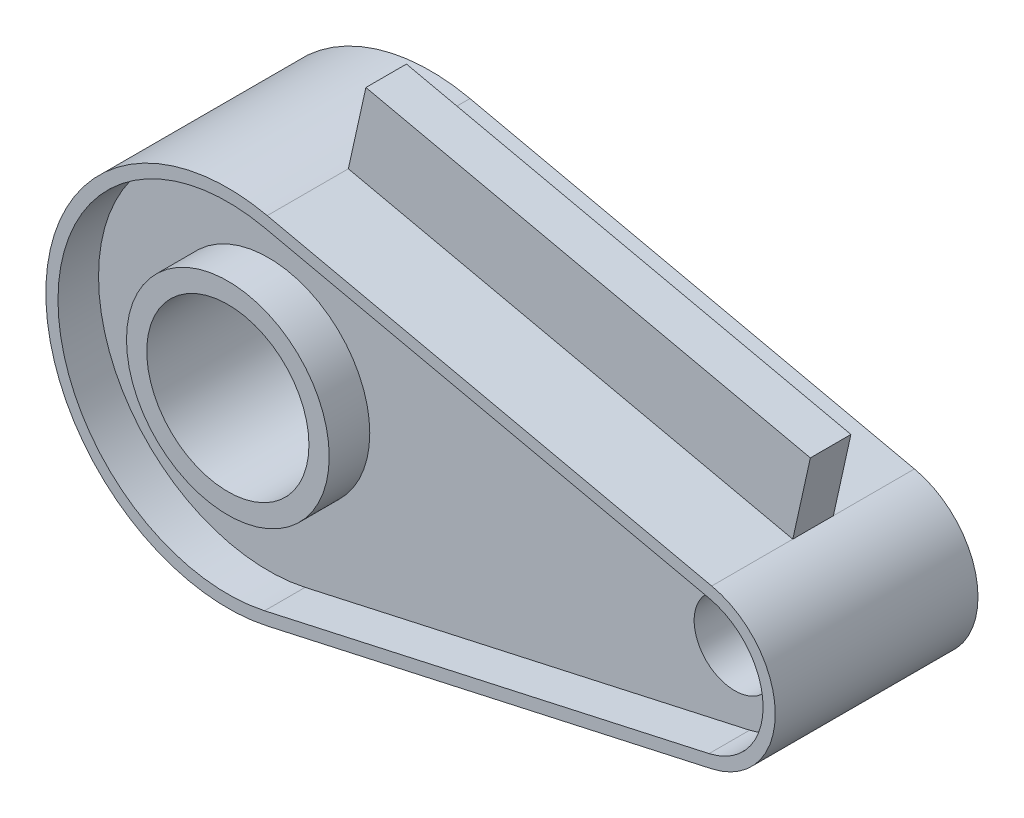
ISO-10303-21;
HEADER;
FILE_DESCRIPTION(('STEP AP214'),'2;1');
FILE_NAME('part.step','',(''),(''),'','','');
FILE_SCHEMA(('AUTOMOTIVE_DESIGN { 1 0 10303 214 1 1 1 1 }'));
ENDSEC;
DATA;
#1=APPLICATION_CONTEXT('core data for automotive mechanical design processes');
#2=APPLICATION_PROTOCOL_DEFINITION('international standard','automotive_design',2000,#1);
#3=PRODUCT_CONTEXT('',#1,'mechanical');
#4=PRODUCT('Part','Part','',(#3));
#5=PRODUCT_RELATED_PRODUCT_CATEGORY('part','',(#4));
#6=PRODUCT_DEFINITION_FORMATION('','',#4);
#7=PRODUCT_DEFINITION_CONTEXT('part definition',#1,'design');
#8=PRODUCT_DEFINITION('design','',#6,#7);
#9=PRODUCT_DEFINITION_SHAPE('','',#8);
#10=(LENGTH_UNIT() NAMED_UNIT(*) SI_UNIT(.MILLI.,.METRE.));
#11=(NAMED_UNIT(*) PLANE_ANGLE_UNIT() SI_UNIT($,.RADIAN.));
#12=(NAMED_UNIT(*) SI_UNIT($,.STERADIAN.) SOLID_ANGLE_UNIT());
#13=UNCERTAINTY_MEASURE_WITH_UNIT(LENGTH_MEASURE(1.E-05),#10,'distance_accuracy_value','');
#14=(GEOMETRIC_REPRESENTATION_CONTEXT(3) GLOBAL_UNCERTAINTY_ASSIGNED_CONTEXT((#13)) GLOBAL_UNIT_ASSIGNED_CONTEXT((#10,
#11,#12)) REPRESENTATION_CONTEXT('',''));
#15=CARTESIAN_POINT('',(0.,0.,0.));
#16=DIRECTION('',(0.,0.,1.));
#17=DIRECTION('',(1.,0.,0.));
#18=AXIS2_PLACEMENT_3D('',#15,#16,#17);
#19=CARTESIAN_POINT('',(-105.283905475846,43.8264701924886,25.));
#20=DIRECTION('',(-0.2164396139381,-0.976296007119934,0.));
#21=DIRECTION('',(0.976296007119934,-0.2164396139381,0.));
#22=AXIS2_PLACEMENT_3D('',#19,#20,#21);
#23=PLANE('',#22);
#24=DIRECTION('',(-0.976296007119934,0.2164396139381,0.));
#25=VECTOR('',#24,1.);
#26=CARTESIAN_POINT('',(-105.283905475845,43.8264701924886,5.));
#27=LINE('',#26,#25);
#28=CARTESIAN_POINT('',(-105.283905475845,43.8264701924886,5.));
#29=VERTEX_POINT('',#28);
#30=CARTESIAN_POINT('',(4.328792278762,19.5259201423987,5.));
#31=VERTEX_POINT('',#30);
#32=EDGE_CURVE('E137',#29,#31,#27,.F.);
#33=ORIENTED_EDGE('',*,*,#32,.F.);
#34=DIRECTION('',(0.,0.,-1.));
#35=VECTOR('',#34,1.);
#36=CARTESIAN_POINT('',(-105.283905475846,43.8264701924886,25.));
#37=LINE('',#36,#35);
#38=CARTESIAN_POINT('',(-105.283905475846,43.8264701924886,25.));
#39=VERTEX_POINT('',#38);
#40=EDGE_CURVE('E153',#39,#29,#37,.T.);
#41=ORIENTED_EDGE('',*,*,#40,.F.);
#42=DIRECTION('',(-0.976296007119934,0.2164396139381,0.));
#43=VECTOR('',#42,1.);
#44=CARTESIAN_POINT('',(-105.283905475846,43.8264701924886,25.));
#45=LINE('',#44,#43);
#46=CARTESIAN_POINT('',(4.328792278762,19.5259201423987,25.));
#47=VERTEX_POINT('',#46);
#48=EDGE_CURVE('E151',#47,#39,#45,.T.);
#49=ORIENTED_EDGE('',*,*,#48,.F.);
#50=DIRECTION('',(0.,0.,-1.));
#51=VECTOR('',#50,1.);
#52=CARTESIAN_POINT('',(4.328792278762,19.5259201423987,25.));
#53=LINE('',#52,#51);
#54=EDGE_CURVE('E11',#47,#31,#53,.T.);
#55=ORIENTED_EDGE('',*,*,#54,.T.);
#56=EDGE_LOOP('',(#33,#41,#49,#55));
#57=FACE_BOUND('',#56,.T.);
#58=ADVANCED_FACE('F33',(#57),#23,.F.);
#59=CARTESIAN_POINT('',(-2.63677968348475E-13,-1.52655665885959E-13,25.));
#60=DIRECTION('',(0.,0.,-1.));
#61=DIRECTION('',(-1.,0.,0.));
#62=AXIS2_PLACEMENT_3D('',#59,#60,#61);
#63=PLANE('',#62);
#64=CARTESIAN_POINT('',(-115.,0.,25.));
#65=DIRECTION('',(0.,0.,1.));
#66=DIRECTION('',(1.,0.,0.));
#67=AXIS2_PLACEMENT_3D('',#64,#65,#66);
#68=CIRCLE('',#67,20.);
#69=CARTESIAN_POINT('',(-95.,0.,25.));
#70=VERTEX_POINT('',#69);
#71=EDGE_CURVE('E199',#70,#70,#68,.T.);
#72=ORIENTED_EDGE('',*,*,#71,.F.);
#73=EDGE_LOOP('',(#72));
#74=FACE_BOUND('',#73,.T.);
#75=CARTESIAN_POINT('',(-115.,0.,25.));
#76=DIRECTION('',(0.,0.,1.));
#77=DIRECTION('',(1.,0.,0.));
#78=AXIS2_PLACEMENT_3D('',#75,#76,#77);
#79=CIRCLE('',#78,25.);
#80=CARTESIAN_POINT('',(-90.,0.,25.));
#81=VERTEX_POINT('',#80);
#82=EDGE_CURVE('E133',#81,#81,#79,.T.);
#83=ORIENTED_EDGE('',*,*,#82,.T.);
#84=EDGE_LOOP('',(#83));
#85=FACE_BOUND('',#84,.T.);
#86=ADVANCED_FACE('F273',(#74,#85),#63,.F.);
#87=CARTESIAN_POINT('',(-2.63677968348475E-13,-1.52655665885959E-13,25.));
#88=DIRECTION('',(0.,0.,-1.));
#89=DIRECTION('',(-1.,0.,0.));
#90=AXIS2_PLACEMENT_3D('',#87,#88,#89);
#91=CYLINDRICAL_SURFACE('',#90,10.);
#92=CARTESIAN_POINT('',(-2.63677968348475E-13,-1.52655665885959E-13,-25.));
#93=DIRECTION('',(0.,0.,1.));
#94=DIRECTION('',(1.,0.,0.));
#95=AXIS2_PLACEMENT_3D('',#92,#93,#94);
#96=CIRCLE('',#95,10.);
#97=CARTESIAN_POINT('',(9.99999999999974,-1.52655665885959E-13,-25.));
#98=VERTEX_POINT('',#97);
#99=EDGE_CURVE('E205',#98,#98,#96,.T.);
#100=ORIENTED_EDGE('',*,*,#99,.F.);
#101=EDGE_LOOP('',(#100));
#102=FACE_BOUND('',#101,.T.);
#103=CARTESIAN_POINT('',(-2.63677968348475E-13,-1.52655665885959E-13,15.));
#104=DIRECTION('',(0.,0.,1.));
#105=DIRECTION('',(1.,0.,0.));
#106=AXIS2_PLACEMENT_3D('',#103,#104,#105);
#107=CIRCLE('',#106,10.);
#108=CARTESIAN_POINT('',(9.99999999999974,-1.52655665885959E-13,15.));
#109=VERTEX_POINT('',#108);
#110=EDGE_CURVE('E37',#109,#109,#107,.T.);
#111=ORIENTED_EDGE('',*,*,#110,.T.);
#112=EDGE_LOOP('',(#111));
#113=FACE_BOUND('',#112,.T.);
#114=ADVANCED_FACE('F277',(#102,#113),#91,.F.);
#115=DIRECTION('',(0.976296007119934,0.216439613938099,0.));
#116=VECTOR('',#115,1.);
#117=CARTESIAN_POINT('',(-105.93322431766,-40.8975821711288,25.));
#118=LINE('',#117,#116);
#119=CARTESIAN_POINT('',(-105.93322431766,-40.8975821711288,25.));
#120=VERTEX_POINT('',#119);
#121=CARTESIAN_POINT('',(3.67947343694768,-16.597032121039,25.));
#122=VERTEX_POINT('',#121);
#123=EDGE_CURVE('E234',#120,#122,#118,.T.);
#124=ORIENTED_EDGE('',*,*,#123,.F.);
#125=CARTESIAN_POINT('',(-115.,0.,25.));
#126=DIRECTION('',(0.,0.,1.));
#127=DIRECTION('',(1.,0.,0.));
#128=AXIS2_PLACEMENT_3D('',#125,#126,#127);
#129=CIRCLE('',#128,41.8905556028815);
#130=CARTESIAN_POINT('',(-105.93322431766,40.8975821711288,25.));
#131=VERTEX_POINT('',#130);
#132=EDGE_CURVE('E57',#131,#120,#129,.T.);
#133=ORIENTED_EDGE('',*,*,#132,.F.);
#134=DIRECTION('',(-0.976296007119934,0.216439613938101,0.));
#135=VECTOR('',#134,1.);
#136=CARTESIAN_POINT('',(3.67947343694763,16.5970321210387,25.));
#137=LINE('',#136,#135);
#138=CARTESIAN_POINT('',(3.67947343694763,16.5970321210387,25.));
#139=VERTEX_POINT('',#138);
#140=EDGE_CURVE('E228',#139,#131,#137,.T.);
#141=ORIENTED_EDGE('',*,*,#140,.F.);
#142=CARTESIAN_POINT('',(-2.63677968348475E-13,-1.52655665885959E-13,25.));
#143=DIRECTION('',(0.,0.,1.));
#144=DIRECTION('',(1.,0.,0.));
#145=AXIS2_PLACEMENT_3D('',#142,#143,#144);
#146=CIRCLE('',#145,17.0000000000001);
#147=EDGE_CURVE('E231',#122,#139,#146,.T.);
#148=ORIENTED_EDGE('',*,*,#147,.F.);
#149=EDGE_LOOP('',(#124,#133,#141,#148));
#150=FACE_BOUND('',#149,.T.);
#151=CARTESIAN_POINT('',(-2.63677968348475E-13,-1.52655665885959E-13,25.));
#152=DIRECTION('',(0.,0.,1.));
#153=DIRECTION('',(-1.,0.,0.));
#154=AXIS2_PLACEMENT_3D('',#151,#152,#153);
#155=CIRCLE('',#154,20.0000000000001);
#156=CARTESIAN_POINT('',(4.328792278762,-19.5259201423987,25.));
#157=VERTEX_POINT('',#156);
#158=EDGE_CURVE('E157',#157,#47,#155,.T.);
#159=ORIENTED_EDGE('',*,*,#158,.T.);
#160=ORIENTED_EDGE('',*,*,#48,.T.);
#161=CARTESIAN_POINT('',(-115.,0.,25.));
#162=DIRECTION('',(0.,0.,1.));
#163=DIRECTION('',(-1.,0.,0.));
#164=AXIS2_PLACEMENT_3D('',#161,#162,#163);
#165=CIRCLE('',#164,44.8905556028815);
#166=CARTESIAN_POINT('',(-105.283905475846,-43.8264701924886,25.));
#167=VERTEX_POINT('',#166);
#168=EDGE_CURVE('E156',#39,#167,#165,.T.);
#169=ORIENTED_EDGE('',*,*,#168,.T.);
#170=DIRECTION('',(0.976296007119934,0.2164396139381,0.));
#171=VECTOR('',#170,1.);
#172=CARTESIAN_POINT('',(4.328792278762,-19.5259201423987,25.));
#173=LINE('',#172,#171);
#174=EDGE_CURVE('E161',#167,#157,#173,.T.);
#175=ORIENTED_EDGE('',*,*,#174,.T.);
#176=EDGE_LOOP('',(#159,#160,#169,#175));
#177=FACE_BOUND('',#176,.T.);
#178=ADVANCED_FACE('F159',(#150,#177),#63,.F.);
#179=CARTESIAN_POINT('',(-2.63677968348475E-13,-1.52655665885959E-13,-25.));
#180=DIRECTION('',(0.,0.,-1.));
#181=DIRECTION('',(-1.,0.,0.));
#182=AXIS2_PLACEMENT_3D('',#179,#180,#181);
#183=PLANE('',#182);
#184=CARTESIAN_POINT('',(-115.,0.,-25.));
#185=DIRECTION('',(0.,0.,1.));
#186=DIRECTION('',(1.,0.,0.));
#187=AXIS2_PLACEMENT_3D('',#184,#185,#186);
#188=CIRCLE('',#187,20.);
#189=CARTESIAN_POINT('',(-95.,0.,-25.));
#190=VERTEX_POINT('',#189);
#191=EDGE_CURVE('E202',#190,#190,#188,.T.);
#192=ORIENTED_EDGE('',*,*,#191,.T.);
#193=EDGE_LOOP('',(#192));
#194=FACE_BOUND('',#193,.T.);
#195=CARTESIAN_POINT('',(-2.63677968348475E-13,-1.52655665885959E-13,-25.));
#196=DIRECTION('',(0.,0.,1.));
#197=DIRECTION('',(-1.,0.,0.));
#198=AXIS2_PLACEMENT_3D('',#195,#196,#197);
#199=CIRCLE('',#198,20.0000000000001);
#200=CARTESIAN_POINT('',(4.328792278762,-19.5259201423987,-25.));
#201=VERTEX_POINT('',#200);
#202=CARTESIAN_POINT('',(4.328792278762,19.5259201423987,-25.));
#203=VERTEX_POINT('',#202);
#204=EDGE_CURVE('E192',#201,#203,#199,.T.);
#205=ORIENTED_EDGE('',*,*,#204,.F.);
#206=DIRECTION('',(0.976296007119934,0.2164396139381,0.));
#207=VECTOR('',#206,1.);
#208=CARTESIAN_POINT('',(4.328792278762,-19.5259201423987,-25.));
#209=LINE('',#208,#207);
#210=CARTESIAN_POINT('',(-105.283905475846,-43.8264701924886,-25.));
#211=VERTEX_POINT('',#210);
#212=EDGE_CURVE('E164',#211,#201,#209,.T.);
#213=ORIENTED_EDGE('',*,*,#212,.F.);
#214=CARTESIAN_POINT('',(-115.,0.,-25.));
#215=DIRECTION('',(0.,0.,1.));
#216=DIRECTION('',(-1.,0.,0.));
#217=AXIS2_PLACEMENT_3D('',#214,#215,#216);
#218=CIRCLE('',#217,44.8905556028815);
#219=CARTESIAN_POINT('',(-105.283905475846,43.8264701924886,-25.));
#220=VERTEX_POINT('',#219);
#221=EDGE_CURVE('E166',#220,#211,#218,.T.);
#222=ORIENTED_EDGE('',*,*,#221,.F.);
#223=DIRECTION('',(-0.976296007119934,0.2164396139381,0.));
#224=VECTOR('',#223,1.);
#225=CARTESIAN_POINT('',(-105.283905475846,43.8264701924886,-25.));
#226=LINE('',#225,#224);
#227=EDGE_CURVE('E188',#203,#220,#226,.T.);
#228=ORIENTED_EDGE('',*,*,#227,.F.);
#229=EDGE_LOOP('',(#205,#213,#222,#228));
#230=FACE_BOUND('',#229,.T.);
#231=ORIENTED_EDGE('',*,*,#99,.T.);
#232=EDGE_LOOP('',(#231));
#233=FACE_BOUND('',#232,.T.);
#234=ADVANCED_FACE('F195',(#194,#230,#233),#183,.T.);
#235=CARTESIAN_POINT('',(-2.63677968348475E-13,-1.52655665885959E-13,25.));
#236=DIRECTION('',(0.,0.,-1.));
#237=DIRECTION('',(-1.,0.,0.));
#238=AXIS2_PLACEMENT_3D('',#235,#236,#237);
#239=CYLINDRICAL_SURFACE('',#238,20.0000000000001);
#240=ORIENTED_EDGE('',*,*,#204,.T.);
#241=CARTESIAN_POINT('',(4.328792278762,19.5259201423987,-5.));
#242=VERTEX_POINT('',#241);
#243=EDGE_CURVE('E42',#242,#203,#53,.T.);
#244=ORIENTED_EDGE('',*,*,#243,.F.);
#245=DIRECTION('',(0.,0.,1.));
#246=VECTOR('',#245,1.);
#247=CARTESIAN_POINT('',(4.328792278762,19.5259201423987,-5.));
#248=LINE('',#247,#246);
#249=EDGE_CURVE('E128',#242,#31,#248,.T.);
#250=ORIENTED_EDGE('',*,*,#249,.T.);
#251=ORIENTED_EDGE('',*,*,#54,.F.);
#252=ORIENTED_EDGE('',*,*,#158,.F.);
#253=DIRECTION('',(0.,0.,-1.));
#254=VECTOR('',#253,1.);
#255=CARTESIAN_POINT('',(4.328792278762,-19.5259201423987,25.));
#256=LINE('',#255,#254);
#257=EDGE_CURVE('E172',#157,#201,#256,.T.);
#258=ORIENTED_EDGE('',*,*,#257,.T.);
#259=EDGE_LOOP('',(#240,#244,#250,#251,#252,#258));
#260=FACE_BOUND('',#259,.T.);
#261=ADVANCED_FACE('F35',(#260),#239,.T.);
#262=CARTESIAN_POINT('',(-105.283905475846,43.8264701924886,-5.));
#263=VERTEX_POINT('',#262);
#264=EDGE_CURVE('E177',#263,#220,#37,.T.);
#265=ORIENTED_EDGE('',*,*,#264,.F.);
#266=DIRECTION('',(-0.976296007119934,0.2164396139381,0.));
#267=VECTOR('',#266,1.);
#268=CARTESIAN_POINT('',(-105.283905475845,43.8264701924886,-5.));
#269=LINE('',#268,#267);
#270=EDGE_CURVE('E49',#263,#242,#269,.F.);
#271=ORIENTED_EDGE('',*,*,#270,.T.);
#272=ORIENTED_EDGE('',*,*,#243,.T.);
#273=ORIENTED_EDGE('',*,*,#227,.T.);
#274=EDGE_LOOP('',(#265,#271,#272,#273));
#275=FACE_BOUND('',#274,.T.);
#276=ADVANCED_FACE('F189',(#275),#23,.F.);
#277=CARTESIAN_POINT('',(-115.,0.,25.));
#278=DIRECTION('',(0.,0.,-1.));
#279=DIRECTION('',(-1.,0.,0.));
#280=AXIS2_PLACEMENT_3D('',#277,#278,#279);
#281=CYLINDRICAL_SURFACE('',#280,44.8905556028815);
#282=ORIENTED_EDGE('',*,*,#221,.T.);
#283=DIRECTION('',(0.,0.,-1.));
#284=VECTOR('',#283,1.);
#285=CARTESIAN_POINT('',(-105.283905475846,-43.8264701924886,25.));
#286=LINE('',#285,#284);
#287=EDGE_CURVE('E174',#167,#211,#286,.T.);
#288=ORIENTED_EDGE('',*,*,#287,.F.);
#289=ORIENTED_EDGE('',*,*,#168,.F.);
#290=ORIENTED_EDGE('',*,*,#40,.T.);
#291=DIRECTION('',(0.,0.,-1.));
#292=VECTOR('',#291,1.);
#293=CARTESIAN_POINT('',(-105.283905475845,43.8264701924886,5.));
#294=LINE('',#293,#292);
#295=EDGE_CURVE('E185',#29,#263,#294,.T.);
#296=ORIENTED_EDGE('',*,*,#295,.T.);
#297=ORIENTED_EDGE('',*,*,#264,.T.);
#298=EDGE_LOOP('',(#282,#288,#289,#290,#296,#297));
#299=FACE_BOUND('',#298,.T.);
#300=ADVANCED_FACE('F182',(#299),#281,.T.);
#301=CARTESIAN_POINT('',(4.328792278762,-19.5259201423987,25.));
#302=DIRECTION('',(-0.2164396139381,0.976296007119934,0.));
#303=DIRECTION('',(-0.976296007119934,-0.2164396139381,0.));
#304=AXIS2_PLACEMENT_3D('',#301,#302,#303);
#305=PLANE('',#304);
#306=ORIENTED_EDGE('',*,*,#212,.T.);
#307=ORIENTED_EDGE('',*,*,#257,.F.);
#308=ORIENTED_EDGE('',*,*,#174,.F.);
#309=ORIENTED_EDGE('',*,*,#287,.T.);
#310=EDGE_LOOP('',(#306,#307,#308,#309));
#311=FACE_BOUND('',#310,.T.);
#312=ADVANCED_FACE('F286',(#311),#305,.F.);
#313=CARTESIAN_POINT('',(-115.,0.,25.));
#314=DIRECTION('',(0.,0.,-1.));
#315=DIRECTION('',(-1.,0.,0.));
#316=AXIS2_PLACEMENT_3D('',#313,#314,#315);
#317=CYLINDRICAL_SURFACE('',#316,20.);
#318=ORIENTED_EDGE('',*,*,#71,.T.);
#319=EDGE_LOOP('',(#318));
#320=FACE_BOUND('',#319,.T.);
#321=ORIENTED_EDGE('',*,*,#191,.F.);
#322=EDGE_LOOP('',(#321));
#323=FACE_BOUND('',#322,.T.);
#324=ADVANCED_FACE('F297',(#320,#323),#317,.F.);
#325=CARTESIAN_POINT('',(-115.,0.,15.));
#326=DIRECTION('',(0.,0.,1.));
#327=DIRECTION('',(1.,0.,0.));
#328=AXIS2_PLACEMENT_3D('',#325,#326,#327);
#329=CYLINDRICAL_SURFACE('',#328,41.8905556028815);
#330=ORIENTED_EDGE('',*,*,#132,.T.);
#331=DIRECTION('',(0.,0.,1.));
#332=VECTOR('',#331,1.);
#333=CARTESIAN_POINT('',(-105.93322431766,-40.8975821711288,15.));
#334=LINE('',#333,#332);
#335=CARTESIAN_POINT('',(-105.93322431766,-40.8975821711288,15.));
#336=VERTEX_POINT('',#335);
#337=EDGE_CURVE('E208',#336,#120,#334,.T.);
#338=ORIENTED_EDGE('',*,*,#337,.F.);
#339=CARTESIAN_POINT('',(-115.,0.,15.));
#340=DIRECTION('',(0.,0.,1.));
#341=DIRECTION('',(1.,0.,0.));
#342=AXIS2_PLACEMENT_3D('',#339,#340,#341);
#343=CIRCLE('',#342,41.8905556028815);
#344=CARTESIAN_POINT('',(-105.93322431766,40.8975821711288,15.));
#345=VERTEX_POINT('',#344);
#346=EDGE_CURVE('E225',#345,#336,#343,.T.);
#347=ORIENTED_EDGE('',*,*,#346,.F.);
#348=DIRECTION('',(0.,0.,1.));
#349=VECTOR('',#348,1.);
#350=CARTESIAN_POINT('',(-105.93322431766,40.8975821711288,15.));
#351=LINE('',#350,#349);
#352=EDGE_CURVE('E215',#345,#131,#351,.T.);
#353=ORIENTED_EDGE('',*,*,#352,.T.);
#354=EDGE_LOOP('',(#330,#338,#347,#353));
#355=FACE_BOUND('',#354,.T.);
#356=ADVANCED_FACE('F305',(#355),#329,.F.);
#357=CARTESIAN_POINT('',(3.67947343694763,16.5970321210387,15.));
#358=DIRECTION('',(0.216439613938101,0.976296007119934,0.));
#359=DIRECTION('',(-0.976296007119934,0.216439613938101,0.));
#360=AXIS2_PLACEMENT_3D('',#357,#358,#359);
#361=PLANE('',#360);
#362=ORIENTED_EDGE('',*,*,#140,.T.);
#363=ORIENTED_EDGE('',*,*,#352,.F.);
#364=DIRECTION('',(-0.976296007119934,0.216439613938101,0.));
#365=VECTOR('',#364,1.);
#366=CARTESIAN_POINT('',(3.67947343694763,16.5970321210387,15.));
#367=LINE('',#366,#365);
#368=CARTESIAN_POINT('',(3.67947343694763,16.5970321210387,15.));
#369=VERTEX_POINT('',#368);
#370=EDGE_CURVE('E211',#369,#345,#367,.T.);
#371=ORIENTED_EDGE('',*,*,#370,.F.);
#372=DIRECTION('',(0.,0.,1.));
#373=VECTOR('',#372,1.);
#374=CARTESIAN_POINT('',(3.67947343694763,16.5970321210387,15.));
#375=LINE('',#374,#373);
#376=EDGE_CURVE('E213',#369,#139,#375,.T.);
#377=ORIENTED_EDGE('',*,*,#376,.T.);
#378=EDGE_LOOP('',(#362,#363,#371,#377));
#379=FACE_BOUND('',#378,.T.);
#380=ADVANCED_FACE('F310',(#379),#361,.F.);
#381=CARTESIAN_POINT('',(-2.63677968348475E-13,-1.52655665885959E-13,15.));
#382=DIRECTION('',(0.,0.,1.));
#383=DIRECTION('',(1.,0.,0.));
#384=AXIS2_PLACEMENT_3D('',#381,#382,#383);
#385=CYLINDRICAL_SURFACE('',#384,17.0000000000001);
#386=ORIENTED_EDGE('',*,*,#147,.T.);
#387=ORIENTED_EDGE('',*,*,#376,.F.);
#388=CARTESIAN_POINT('',(-2.63677968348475E-13,-1.52655665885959E-13,15.));
#389=DIRECTION('',(0.,0.,1.));
#390=DIRECTION('',(1.,0.,0.));
#391=AXIS2_PLACEMENT_3D('',#388,#389,#390);
#392=CIRCLE('',#391,17.0000000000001);
#393=CARTESIAN_POINT('',(3.67947343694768,-16.597032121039,15.));
#394=VERTEX_POINT('',#393);
#395=EDGE_CURVE('E219',#394,#369,#392,.T.);
#396=ORIENTED_EDGE('',*,*,#395,.F.);
#397=DIRECTION('',(0.,0.,1.));
#398=VECTOR('',#397,1.);
#399=CARTESIAN_POINT('',(3.67947343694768,-16.597032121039,15.));
#400=LINE('',#399,#398);
#401=EDGE_CURVE('E210',#394,#122,#400,.T.);
#402=ORIENTED_EDGE('',*,*,#401,.T.);
#403=EDGE_LOOP('',(#386,#387,#396,#402));
#404=FACE_BOUND('',#403,.T.);
#405=ADVANCED_FACE('F334',(#404),#385,.F.);
#406=CARTESIAN_POINT('',(-105.93322431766,-40.8975821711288,15.));
#407=DIRECTION('',(0.216439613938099,-0.976296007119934,0.));
#408=DIRECTION('',(0.976296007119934,0.216439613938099,0.));
#409=AXIS2_PLACEMENT_3D('',#406,#407,#408);
#410=PLANE('',#409);
#411=ORIENTED_EDGE('',*,*,#123,.T.);
#412=ORIENTED_EDGE('',*,*,#401,.F.);
#413=DIRECTION('',(0.976296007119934,0.216439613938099,0.));
#414=VECTOR('',#413,1.);
#415=CARTESIAN_POINT('',(-105.93322431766,-40.8975821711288,15.));
#416=LINE('',#415,#414);
#417=EDGE_CURVE('E222',#336,#394,#416,.T.);
#418=ORIENTED_EDGE('',*,*,#417,.F.);
#419=ORIENTED_EDGE('',*,*,#337,.T.);
#420=EDGE_LOOP('',(#411,#412,#418,#419));
#421=FACE_BOUND('',#420,.T.);
#422=ADVANCED_FACE('F328',(#421),#410,.F.);
#423=CARTESIAN_POINT('',(-115.,0.,15.));
#424=DIRECTION('',(0.,0.,1.));
#425=DIRECTION('',(1.,0.,0.));
#426=AXIS2_PLACEMENT_3D('',#423,#424,#425);
#427=PLANE('',#426);
#428=ORIENTED_EDGE('',*,*,#110,.F.);
#429=EDGE_LOOP('',(#428));
#430=FACE_BOUND('',#429,.T.);
#431=CARTESIAN_POINT('',(-115.,0.,15.));
#432=DIRECTION('',(0.,0.,1.));
#433=DIRECTION('',(1.,0.,0.));
#434=AXIS2_PLACEMENT_3D('',#431,#432,#433);
#435=CIRCLE('',#434,25.);
#436=CARTESIAN_POINT('',(-90.,0.,15.));
#437=VERTEX_POINT('',#436);
#438=EDGE_CURVE('E238',#437,#437,#435,.T.);
#439=ORIENTED_EDGE('',*,*,#438,.F.);
#440=EDGE_LOOP('',(#439));
#441=FACE_BOUND('',#440,.T.);
#442=ORIENTED_EDGE('',*,*,#346,.T.);
#443=ORIENTED_EDGE('',*,*,#417,.T.);
#444=ORIENTED_EDGE('',*,*,#395,.T.);
#445=ORIENTED_EDGE('',*,*,#370,.T.);
#446=EDGE_LOOP('',(#442,#443,#444,#445));
#447=FACE_BOUND('',#446,.T.);
#448=ADVANCED_FACE('F320',(#430,#441,#447),#427,.T.);
#449=CARTESIAN_POINT('',(-115.,0.,15.));
#450=DIRECTION('',(0.,0.,1.));
#451=DIRECTION('',(1.,0.,0.));
#452=AXIS2_PLACEMENT_3D('',#449,#450,#451);
#453=CYLINDRICAL_SURFACE('',#452,25.);
#454=ORIENTED_EDGE('',*,*,#438,.T.);
#455=EDGE_LOOP('',(#454));
#456=FACE_BOUND('',#455,.T.);
#457=ORIENTED_EDGE('',*,*,#82,.F.);
#458=EDGE_LOOP('',(#457));
#459=FACE_BOUND('',#458,.T.);
#460=ADVANCED_FACE('F318',(#456,#459),#453,.T.);
#461=CARTESIAN_POINT('',(-100.955113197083,63.3523903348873,5.));
#462=DIRECTION('',(0.,0.,-1.));
#463=DIRECTION('',(-1.,0.,0.));
#464=AXIS2_PLACEMENT_3D('',#461,#462,#463);
#465=PLANE('',#464);
#466=ORIENTED_EDGE('',*,*,#32,.T.);
#467=DIRECTION('',(-0.2164396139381,-0.976296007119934,0.));
#468=VECTOR('',#467,1.);
#469=CARTESIAN_POINT('',(8.657584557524,39.0518402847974,5.));
#470=LINE('',#469,#468);
#471=CARTESIAN_POINT('',(8.657584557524,39.0518402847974,5.));
#472=VERTEX_POINT('',#471);
#473=EDGE_CURVE('E124',#472,#31,#470,.T.);
#474=ORIENTED_EDGE('',*,*,#473,.F.);
#475=DIRECTION('',(-0.976296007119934,0.2164396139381,0.));
#476=VECTOR('',#475,1.);
#477=CARTESIAN_POINT('',(-100.955113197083,63.3523903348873,5.));
#478=LINE('',#477,#476);
#479=CARTESIAN_POINT('',(-100.955113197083,63.3523903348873,5.));
#480=VERTEX_POINT('',#479);
#481=EDGE_CURVE('E254',#480,#472,#478,.F.);
#482=ORIENTED_EDGE('',*,*,#481,.F.);
#483=DIRECTION('',(-0.2164396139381,-0.976296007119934,0.));
#484=VECTOR('',#483,1.);
#485=CARTESIAN_POINT('',(-100.955113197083,63.3523903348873,5.));
#486=LINE('',#485,#484);
#487=EDGE_CURVE('E139',#480,#29,#486,.T.);
#488=ORIENTED_EDGE('',*,*,#487,.T.);
#489=EDGE_LOOP('',(#466,#474,#482,#488));
#490=FACE_BOUND('',#489,.T.);
#491=ADVANCED_FACE('F138',(#490),#465,.F.);
#492=CARTESIAN_POINT('',(8.657584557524,39.0518402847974,-5.));
#493=DIRECTION('',(0.976296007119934,-0.2164396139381,0.));
#494=DIRECTION('',(0.2164396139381,0.976296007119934,0.));
#495=AXIS2_PLACEMENT_3D('',#492,#493,#494);
#496=PLANE('',#495);
#497=ORIENTED_EDGE('',*,*,#249,.F.);
#498=DIRECTION('',(-0.2164396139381,-0.976296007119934,0.));
#499=VECTOR('',#498,1.);
#500=CARTESIAN_POINT('',(8.657584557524,39.0518402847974,-5.));
#501=LINE('',#500,#499);
#502=CARTESIAN_POINT('',(8.657584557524,39.0518402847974,-5.));
#503=VERTEX_POINT('',#502);
#504=EDGE_CURVE('E134',#503,#242,#501,.T.);
#505=ORIENTED_EDGE('',*,*,#504,.F.);
#506=DIRECTION('',(0.,0.,1.));
#507=VECTOR('',#506,1.);
#508=CARTESIAN_POINT('',(8.657584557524,39.0518402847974,-5.));
#509=LINE('',#508,#507);
#510=EDGE_CURVE('E130',#503,#472,#509,.T.);
#511=ORIENTED_EDGE('',*,*,#510,.T.);
#512=ORIENTED_EDGE('',*,*,#473,.T.);
#513=EDGE_LOOP('',(#497,#505,#511,#512));
#514=FACE_BOUND('',#513,.T.);
#515=ADVANCED_FACE('F126',(#514),#496,.T.);
#516=CARTESIAN_POINT('',(-100.955113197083,63.3523903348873,-5.));
#517=DIRECTION('',(0.,0.,-1.));
#518=DIRECTION('',(-1.,0.,0.));
#519=AXIS2_PLACEMENT_3D('',#516,#517,#518);
#520=PLANE('',#519);
#521=ORIENTED_EDGE('',*,*,#270,.F.);
#522=DIRECTION('',(-0.2164396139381,-0.976296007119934,0.));
#523=VECTOR('',#522,1.);
#524=CARTESIAN_POINT('',(-100.955113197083,63.3523903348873,-5.));
#525=LINE('',#524,#523);
#526=CARTESIAN_POINT('',(-100.955113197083,63.3523903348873,-5.));
#527=VERTEX_POINT('',#526);
#528=EDGE_CURVE('E244',#527,#263,#525,.T.);
#529=ORIENTED_EDGE('',*,*,#528,.F.);
#530=DIRECTION('',(-0.976296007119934,0.2164396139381,0.));
#531=VECTOR('',#530,1.);
#532=CARTESIAN_POINT('',(-100.955113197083,63.3523903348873,-5.));
#533=LINE('',#532,#531);
#534=EDGE_CURVE('E250',#527,#503,#533,.F.);
#535=ORIENTED_EDGE('',*,*,#534,.T.);
#536=ORIENTED_EDGE('',*,*,#504,.T.);
#537=EDGE_LOOP('',(#521,#529,#535,#536));
#538=FACE_BOUND('',#537,.T.);
#539=ADVANCED_FACE('F263',(#538),#520,.T.);
#540=CARTESIAN_POINT('',(-100.955113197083,63.3523903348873,5.));
#541=DIRECTION('',(-0.976296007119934,0.2164396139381,0.));
#542=DIRECTION('',(-0.2164396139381,-0.976296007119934,0.));
#543=AXIS2_PLACEMENT_3D('',#540,#541,#542);
#544=PLANE('',#543);
#545=ORIENTED_EDGE('',*,*,#295,.F.);
#546=ORIENTED_EDGE('',*,*,#487,.F.);
#547=DIRECTION('',(0.,0.,-1.));
#548=VECTOR('',#547,1.);
#549=CARTESIAN_POINT('',(-100.955113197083,63.3523903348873,5.));
#550=LINE('',#549,#548);
#551=EDGE_CURVE('E247',#480,#527,#550,.T.);
#552=ORIENTED_EDGE('',*,*,#551,.T.);
#553=ORIENTED_EDGE('',*,*,#528,.T.);
#554=EDGE_LOOP('',(#545,#546,#552,#553));
#555=FACE_BOUND('',#554,.T.);
#556=ADVANCED_FACE('F262',(#555),#544,.T.);
#557=CARTESIAN_POINT('',(8.657584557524,39.0518402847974,5.));
#558=DIRECTION('',(0.2164396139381,0.976296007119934,0.));
#559=DIRECTION('',(-0.976296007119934,0.2164396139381,0.));
#560=AXIS2_PLACEMENT_3D('',#557,#558,#559);
#561=PLANE('',#560);
#562=ORIENTED_EDGE('',*,*,#481,.T.);
#563=ORIENTED_EDGE('',*,*,#510,.F.);
#564=ORIENTED_EDGE('',*,*,#534,.F.);
#565=ORIENTED_EDGE('',*,*,#551,.F.);
#566=EDGE_LOOP('',(#562,#563,#564,#565));
#567=FACE_BOUND('',#566,.T.);
#568=ADVANCED_FACE('F259',(#567),#561,.T.);
#569=CLOSED_SHELL('',(#58,#86,#114,#178,#234,#261,#276,#300,#312,#324,#356,#380,#405,#422,#448,
#460,#491,#515,#539,#556,#568));
#570=MANIFOLD_SOLID_BREP('B2',#569);
#571=ADVANCED_BREP_SHAPE_REPRESENTATION('',(#18,#570),#14);
#572=SHAPE_DEFINITION_REPRESENTATION(#9,#571);
ENDSEC;
END-ISO-10303-21;
